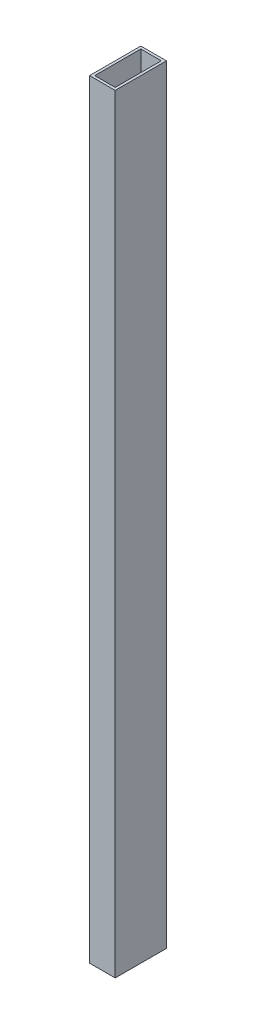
from build123d import *

# Parameters (mm, degrees)
SKETCH1_W           = 10
SKETCH1_H           = 20
SKETCH1_W_2         = 8
SKETCH1_H_2         = 18
BOSS_EXTRUDE1_DEPTH = 300


with BuildPart() as part:
    # Sketch1 → Boss-Extrude1 (new body)
    with BuildSketch(Plane(origin=(0, 0, 0), x_dir=(1, 0, 0), z_dir=(0, 1, 0))):
        Rectangle(SKETCH1_W, SKETCH1_H)
        Rectangle(SKETCH1_W_2, SKETCH1_H_2, mode=Mode.SUBTRACT)
    extrude(amount=BOSS_EXTRUDE1_DEPTH)


solid = part.part
